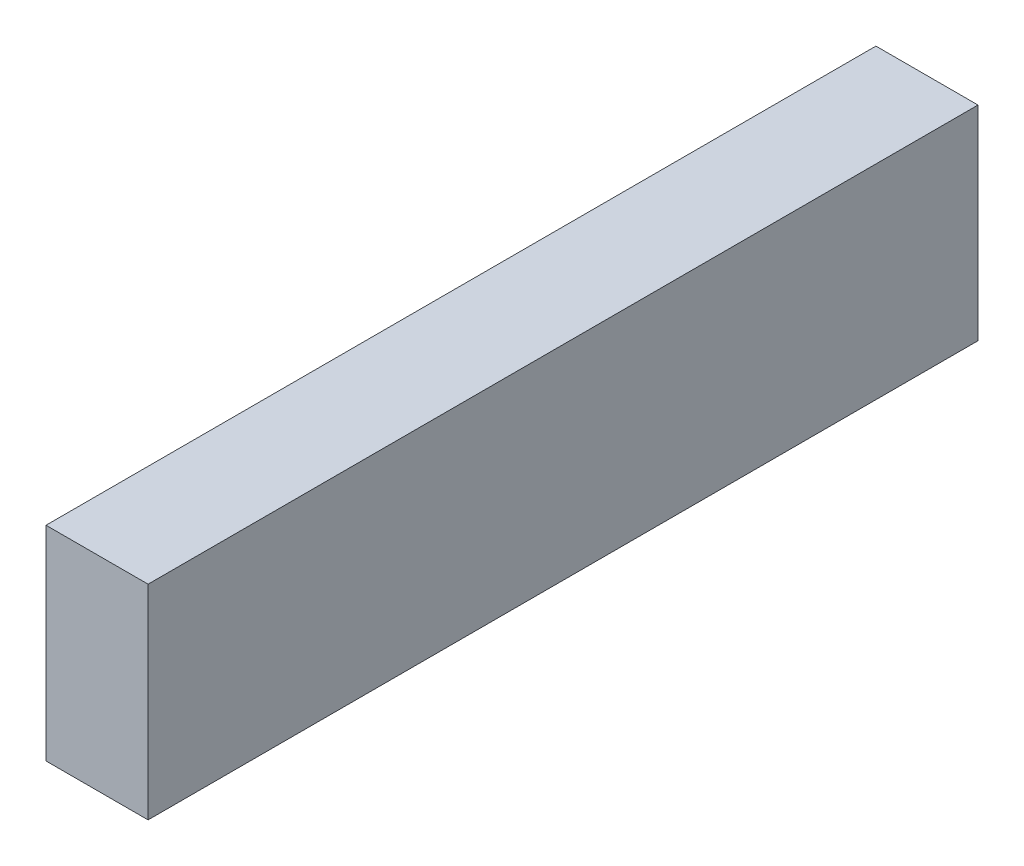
from build123d import *

# Parameters (mm, degrees)
SKETCH1_W           = 8.13
SKETCH1_H           = 2
BOSS_EXTRUDE1_DEPTH = 1


with BuildPart() as part:
    # Sketch1 → Boss-Extrude1 (new body)
    with BuildSketch(Plane(origin=(0, 0, 0), x_dir=(0, 0, -1), z_dir=(1, 0, 0))):
        with Locations((-97.814296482, 0.571030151)):
            Rectangle(SKETCH1_W, SKETCH1_H)
    extrude(amount=BOSS_EXTRUDE1_DEPTH)


solid = part.part
